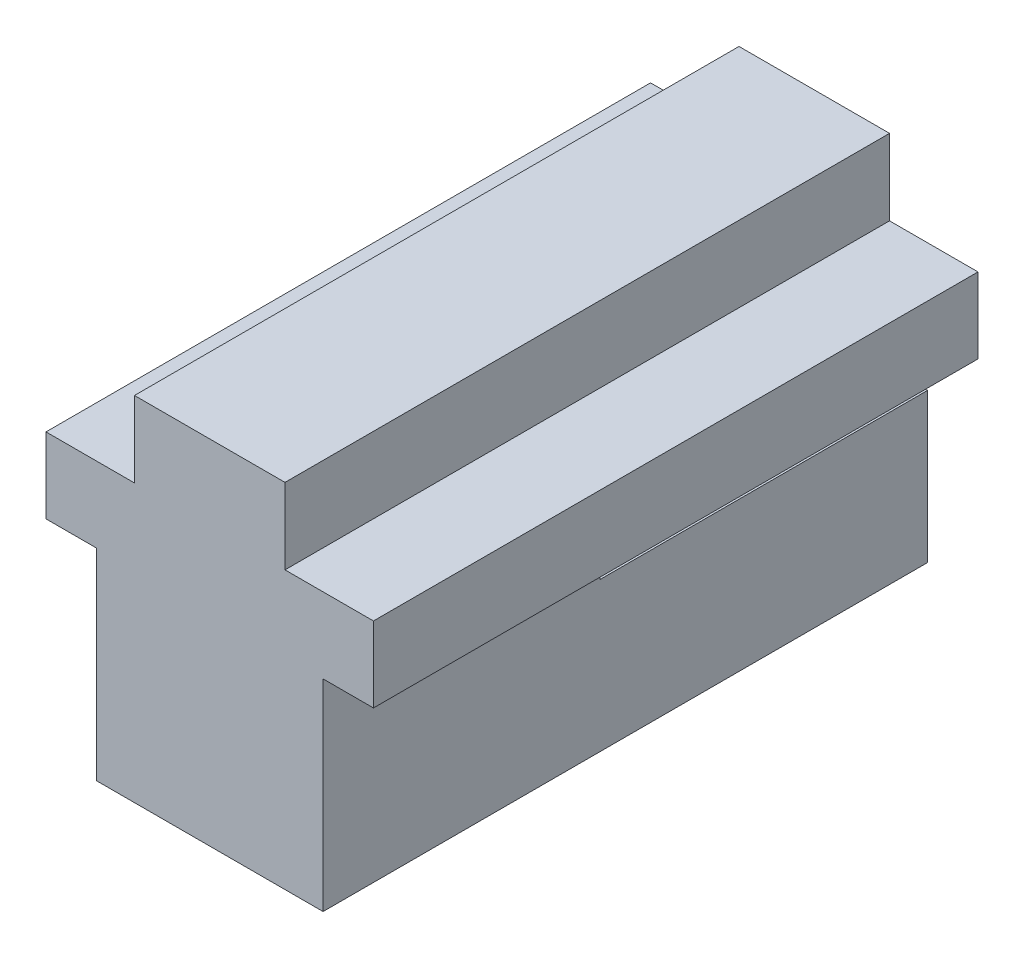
from build123d import *

# Parameters (mm, degrees)
BOSS_EXTRUDE1_DEPTH              = 76.2
SKETCH3_R                        = 2.3876
CUT_EXTRUDE1_DEPTH               = 6.35
F_10_32_TAPPED_HOLE1_D           = 4.0386
F_10_32_TAPPED_HOLE1_DEPTH       = 11.938
F_10_32_TAPPED_HOLE1_CSINK_D     = 6.096
F_10_32_TAPPED_HOLE1_CSINK_ANGLE = 90
F_10_32_TAPPED_HOLE1_TIP         = 1.213317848
CUT_EXTRUDE2_DEPTH               = 89.550975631
CUT_EXTRUDE2_DEPTH_BACK          = 89.550975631
SKETCH6_W                        = 41.275
SKETCH6_H                        = 6.604


with BuildPart() as part:
    # Sketch2 → Boss-Extrude1 (new body)
    with BuildSketch(Plane.XY):
        Polygon((31.9151, -3.1496), (38.2651, -3.1496), (38.2651, 6.35), (27.1145, 6.35), (27.1145, 15.9004), (8.1407, 15.9004), (8.1407, 6.35), (-3.0099, 6.35), (-3.0099, -3.1496), (3.3401, -3.1496), (3.3401, -28.5496), (31.9151, -28.5496), align=None)
    extrude(amount=-BOSS_EXTRUDE1_DEPTH)

    # Sketch3 → Cut-Extrude1 (cut)
    with BuildSketch(Plane.XZ.offset(28.5496)):
        with Locations((8.1026, -17.4625)):
            Circle(SKETCH3_R)
        with Locations((27.1526, -17.4625)):
            Circle(SKETCH3_R)
    extrude(amount=-CUT_EXTRUDE1_DEPTH, mode=Mode.SUBTRACT)

    # 10-32 Tapped Hole1
    with Locations(Plane(origin=(0, -28.5496, 0), x_dir=(-1, 0, 0), z_dir=(0, -1, 0))):
        with Locations((-17.6276, 4.7625), (-17.6276, 30.1625), (44.324250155, 39.289392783)):
            CounterSinkHole(F_10_32_TAPPED_HOLE1_D / 2, F_10_32_TAPPED_HOLE1_CSINK_D / 2, depth=F_10_32_TAPPED_HOLE1_DEPTH, counter_sink_angle=F_10_32_TAPPED_HOLE1_CSINK_ANGLE)
            with Locations((0, 0, -(F_10_32_TAPPED_HOLE1_DEPTH + F_10_32_TAPPED_HOLE1_TIP / 2))):  # 118° drill point
                Cone(0, F_10_32_TAPPED_HOLE1_D / 2, F_10_32_TAPPED_HOLE1_TIP, mode=Mode.SUBTRACT)

    # Sketch6 → Cut-Extrude2 (cut, two sides: drawn at the far end of the back side and taken through both)
    with BuildSketch(Plane.ZY.offset(-3.3401).offset(-CUT_EXTRUDE2_DEPTH_BACK)):
        with Locations((-55.5625, -6.4516)):
            Rectangle(SKETCH6_W, SKETCH6_H)
    extrude(amount=CUT_EXTRUDE2_DEPTH + CUT_EXTRUDE2_DEPTH_BACK, mode=Mode.SUBTRACT)


solid = part.part
